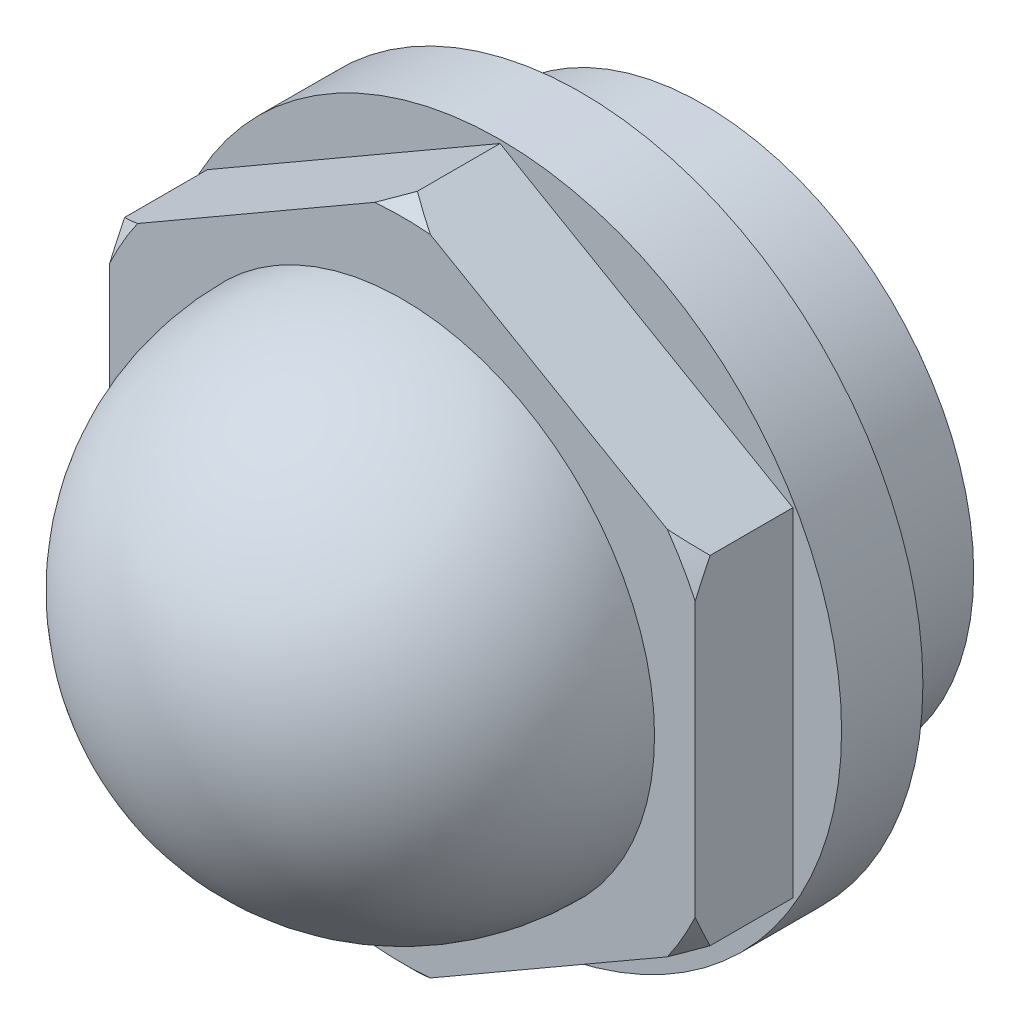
ISO-10303-21;
HEADER;
FILE_DESCRIPTION(('STEP AP214'),'2;1');
FILE_NAME('part.step','',(''),(''),'','','');
FILE_SCHEMA(('AUTOMOTIVE_DESIGN { 1 0 10303 214 1 1 1 1 }'));
ENDSEC;
DATA;
#1=APPLICATION_CONTEXT('core data for automotive mechanical design processes');
#2=APPLICATION_PROTOCOL_DEFINITION('international standard','automotive_design',2000,#1);
#3=PRODUCT_CONTEXT('',#1,'mechanical');
#4=PRODUCT('Part','Part','',(#3));
#5=PRODUCT_RELATED_PRODUCT_CATEGORY('part','',(#4));
#6=PRODUCT_DEFINITION_FORMATION('','',#4);
#7=PRODUCT_DEFINITION_CONTEXT('part definition',#1,'design');
#8=PRODUCT_DEFINITION('design','',#6,#7);
#9=PRODUCT_DEFINITION_SHAPE('','',#8);
#10=(LENGTH_UNIT() NAMED_UNIT(*) SI_UNIT(.MILLI.,.METRE.));
#11=(NAMED_UNIT(*) PLANE_ANGLE_UNIT() SI_UNIT($,.RADIAN.));
#12=(NAMED_UNIT(*) SI_UNIT($,.STERADIAN.) SOLID_ANGLE_UNIT());
#13=UNCERTAINTY_MEASURE_WITH_UNIT(LENGTH_MEASURE(1.E-05),#10,'distance_accuracy_value','');
#14=(GEOMETRIC_REPRESENTATION_CONTEXT(3) GLOBAL_UNCERTAINTY_ASSIGNED_CONTEXT((#13)) GLOBAL_UNIT_ASSIGNED_CONTEXT((#10,
#11,#12)) REPRESENTATION_CONTEXT('',''));
#15=CARTESIAN_POINT('',(0.,0.,0.));
#16=DIRECTION('',(0.,0.,1.));
#17=DIRECTION('',(1.,0.,0.));
#18=AXIS2_PLACEMENT_3D('',#15,#16,#17);
#19=CARTESIAN_POINT('',(0.,0.,-11.));
#20=DIRECTION('',(0.,0.,-1.));
#21=DIRECTION('',(1.,0.,0.));
#22=AXIS2_PLACEMENT_3D('',#19,#20,#21);
#23=CYLINDRICAL_SURFACE('',#22,21.);
#24=CARTESIAN_POINT('',(0.,0.,0.));
#25=DIRECTION('',(0.,0.,-1.));
#26=DIRECTION('',(1.,0.,0.));
#27=AXIS2_PLACEMENT_3D('',#24,#25,#26);
#28=CIRCLE('',#27,21.);
#29=CARTESIAN_POINT('',(21.,0.,0.));
#30=VERTEX_POINT('',#29);
#31=EDGE_CURVE('E251',#30,#30,#28,.T.);
#32=ORIENTED_EDGE('',*,*,#31,.F.);
#33=EDGE_LOOP('',(#32));
#34=FACE_BOUND('',#33,.T.);
#35=CARTESIAN_POINT('',(0.,0.,5.));
#36=DIRECTION('',(0.,0.,1.));
#37=DIRECTION('',(-1.,0.,0.));
#38=AXIS2_PLACEMENT_3D('',#35,#36,#37);
#39=CIRCLE('',#38,21.);
#40=CARTESIAN_POINT('',(-21.,0.,5.));
#41=VERTEX_POINT('',#40);
#42=EDGE_CURVE('E18',#41,#41,#39,.T.);
#43=ORIENTED_EDGE('',*,*,#42,.F.);
#44=EDGE_LOOP('',(#43));
#45=FACE_BOUND('',#44,.T.);
#46=ADVANCED_FACE('F14',(#34,#45),#23,.T.);
#47=CARTESIAN_POINT('',(0.,-15.1455,-7.5));
#48=DIRECTION('',(0.,0.,-1.));
#49=DIRECTION('',(1.,0.,0.));
#50=AXIS2_PLACEMENT_3D('',#47,#48,#49);
#51=PLANE('',#50);
#52=CARTESIAN_POINT('',(0.,0.,-7.5));
#53=DIRECTION('',(0.,0.,-1.));
#54=DIRECTION('',(1.,0.,0.));
#55=AXIS2_PLACEMENT_3D('',#52,#53,#54);
#56=CIRCLE('',#55,16.6245000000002);
#57=CARTESIAN_POINT('',(16.6245000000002,0.,-7.5));
#58=VERTEX_POINT('',#57);
#59=EDGE_CURVE('E9',#58,#58,#56,.T.);
#60=ORIENTED_EDGE('',*,*,#59,.T.);
#61=EDGE_LOOP('',(#60));
#62=FACE_BOUND('',#61,.T.);
#63=CARTESIAN_POINT('',(0.,0.,-7.5));
#64=DIRECTION('',(0.,0.,-1.));
#65=DIRECTION('',(1.,0.,0.));
#66=AXIS2_PLACEMENT_3D('',#63,#64,#65);
#67=CIRCLE('',#66,15.1455);
#68=CARTESIAN_POINT('',(15.1455,0.,-7.5));
#69=VERTEX_POINT('',#68);
#70=EDGE_CURVE('E238',#69,#69,#67,.T.);
#71=ORIENTED_EDGE('',*,*,#70,.F.);
#72=EDGE_LOOP('',(#71));
#73=FACE_BOUND('',#72,.T.);
#74=ADVANCED_FACE('F16',(#62,#73),#51,.T.);
#75=CARTESIAN_POINT('',(0.,0.,-11.));
#76=DIRECTION('',(0.,0.,-1.));
#77=DIRECTION('',(1.,0.,0.));
#78=AXIS2_PLACEMENT_3D('',#75,#76,#77);
#79=CYLINDRICAL_SURFACE('',#78,16.6245000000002);
#80=ORIENTED_EDGE('',*,*,#59,.F.);
#81=EDGE_LOOP('',(#80));
#82=FACE_BOUND('',#81,.T.);
#83=CARTESIAN_POINT('',(0.,0.,0.));
#84=DIRECTION('',(0.,0.,-1.));
#85=DIRECTION('',(1.,0.,0.));
#86=AXIS2_PLACEMENT_3D('',#83,#84,#85);
#87=CIRCLE('',#86,16.6245000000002);
#88=CARTESIAN_POINT('',(16.6245000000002,0.,0.));
#89=VERTEX_POINT('',#88);
#90=EDGE_CURVE('E23',#89,#89,#87,.T.);
#91=ORIENTED_EDGE('',*,*,#90,.T.);
#92=EDGE_LOOP('',(#91));
#93=FACE_BOUND('',#92,.T.);
#94=ADVANCED_FACE('F258',(#82,#93),#79,.T.);
#95=CARTESIAN_POINT('',(0.,-21.,0.));
#96=DIRECTION('',(0.,0.,1.));
#97=DIRECTION('',(-1.,0.,0.));
#98=AXIS2_PLACEMENT_3D('',#95,#96,#97);
#99=PLANE('',#98);
#100=ORIENTED_EDGE('',*,*,#90,.F.);
#101=EDGE_LOOP('',(#100));
#102=FACE_BOUND('',#101,.T.);
#103=ORIENTED_EDGE('',*,*,#31,.T.);
#104=EDGE_LOOP('',(#103));
#105=FACE_BOUND('',#104,.T.);
#106=ADVANCED_FACE('F260',(#102,#105),#99,.F.);
#107=CARTESIAN_POINT('',(0.,0.,-8.5));
#108=DIRECTION('',(0.,0.,-1.));
#109=DIRECTION('',(1.,0.,0.));
#110=AXIS2_PLACEMENT_3D('',#107,#108,#109);
#111=PLANE('',#110);
#112=CARTESIAN_POINT('',(0.,0.,-8.5));
#113=DIRECTION('',(0.,0.,-1.));
#114=DIRECTION('',(1.,0.,0.));
#115=AXIS2_PLACEMENT_3D('',#112,#113,#114);
#116=CIRCLE('',#115,15.1455);
#117=CARTESIAN_POINT('',(15.1455,0.,-8.5));
#118=VERTEX_POINT('',#117);
#119=EDGE_CURVE('E241',#118,#118,#116,.T.);
#120=ORIENTED_EDGE('',*,*,#119,.T.);
#121=EDGE_LOOP('',(#120));
#122=FACE_BOUND('',#121,.T.);
#123=ADVANCED_FACE('F263',(#122),#111,.T.);
#124=CARTESIAN_POINT('',(0.,0.,-11.));
#125=DIRECTION('',(0.,0.,-1.));
#126=DIRECTION('',(1.,0.,0.));
#127=AXIS2_PLACEMENT_3D('',#124,#125,#126);
#128=CYLINDRICAL_SURFACE('',#127,15.1455);
#129=ORIENTED_EDGE('',*,*,#119,.F.);
#130=EDGE_LOOP('',(#129));
#131=FACE_BOUND('',#130,.T.);
#132=ORIENTED_EDGE('',*,*,#70,.T.);
#133=EDGE_LOOP('',(#132));
#134=FACE_BOUND('',#133,.T.);
#135=ADVANCED_FACE('F272',(#131,#134),#128,.T.);
#136=CARTESIAN_POINT('',(0.,0.,5.));
#137=DIRECTION('',(0.,0.,1.));
#138=DIRECTION('',(-1.,0.,0.));
#139=AXIS2_PLACEMENT_3D('',#136,#137,#138);
#140=PLANE('',#139);
#141=DIRECTION('',(0.,1.,0.));
#142=VECTOR('',#141,1.);
#143=CARTESIAN_POINT('',(-17.9999999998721,-10.3923048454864,5.));
#144=LINE('',#143,#142);
#145=CARTESIAN_POINT('',(-17.9999999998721,-10.3923048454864,5.));
#146=VERTEX_POINT('',#145);
#147=CARTESIAN_POINT('',(-17.9999999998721,10.39230484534,5.));
#148=VERTEX_POINT('',#147);
#149=EDGE_CURVE('E112',#146,#148,#144,.T.);
#150=ORIENTED_EDGE('',*,*,#149,.T.);
#151=DIRECTION('',(0.866025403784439,0.5,0.));
#152=VECTOR('',#151,1.);
#153=CARTESIAN_POINT('',(-17.9999999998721,10.39230484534,5.));
#154=LINE('',#153,#152);
#155=CARTESIAN_POINT('',(1.27921978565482E-10,20.7846096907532,5.));
#156=VERTEX_POINT('',#155);
#157=EDGE_CURVE('E139',#148,#156,#154,.T.);
#158=ORIENTED_EDGE('',*,*,#157,.T.);
#159=DIRECTION('',(-0.866025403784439,0.5,0.));
#160=VECTOR('',#159,1.);
#161=CARTESIAN_POINT('',(18.0000000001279,10.39230484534,5.));
#162=LINE('',#161,#160);
#163=CARTESIAN_POINT('',(18.0000000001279,10.39230484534,5.));
#164=VERTEX_POINT('',#163);
#165=EDGE_CURVE('E136',#164,#156,#162,.T.);
#166=ORIENTED_EDGE('',*,*,#165,.F.);
#167=DIRECTION('',(0.,1.,0.));
#168=VECTOR('',#167,1.);
#169=CARTESIAN_POINT('',(18.0000000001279,-10.3923048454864,5.));
#170=LINE('',#169,#168);
#171=CARTESIAN_POINT('',(18.0000000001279,-10.3923048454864,5.));
#172=VERTEX_POINT('',#171);
#173=EDGE_CURVE('E123',#172,#164,#170,.T.);
#174=ORIENTED_EDGE('',*,*,#173,.F.);
#175=DIRECTION('',(-0.866025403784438,-0.5,0.));
#176=VECTOR('',#175,1.);
#177=CARTESIAN_POINT('',(18.0000000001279,-10.3923048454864,5.));
#178=LINE('',#177,#176);
#179=CARTESIAN_POINT('',(1.27935856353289E-10,-20.7846096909,5.));
#180=VERTEX_POINT('',#179);
#181=EDGE_CURVE('E107',#172,#180,#178,.T.);
#182=ORIENTED_EDGE('',*,*,#181,.T.);
#183=DIRECTION('',(0.866025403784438,-0.5,0.));
#184=VECTOR('',#183,1.);
#185=CARTESIAN_POINT('',(-17.9999999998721,-10.3923048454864,5.));
#186=LINE('',#185,#184);
#187=EDGE_CURVE('E119',#146,#180,#186,.T.);
#188=ORIENTED_EDGE('',*,*,#187,.F.);
#189=EDGE_LOOP('',(#150,#158,#166,#174,#182,#188));
#190=FACE_BOUND('',#189,.T.);
#191=ORIENTED_EDGE('',*,*,#42,.T.);
#192=EDGE_LOOP('',(#191));
#193=FACE_BOUND('',#192,.T.);
#194=ADVANCED_FACE('F117',(#190,#193),#140,.T.);
#195=CARTESIAN_POINT('',(-17.9999999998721,-10.3923048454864,5.));
#196=DIRECTION('',(-0.5,-0.866025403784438,0.));
#197=DIRECTION('',(-0.866025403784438,0.5,0.));
#198=AXIS2_PLACEMENT_3D('',#195,#196,#197);
#199=PLANE('',#198);
#200=CARTESIAN_POINT('',(0.854085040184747,-21.2777159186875,9.57524039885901));
#201=CARTESIAN_POINT('',(0.590182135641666,-21.1253515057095,9.73804720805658));
#202=CARTESIAN_POINT('',(0.324592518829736,-20.9720132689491,9.89725928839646));
#203=CARTESIAN_POINT('',(-0.210225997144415,-20.6632356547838,10.2075164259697));
#204=CARTESIAN_POINT('',(-0.479455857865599,-20.5077957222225,10.3585592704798));
#205=CARTESIAN_POINT('',(-1.02266847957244,-20.1941717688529,10.6519461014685));
#206=CARTESIAN_POINT('',(-1.2966650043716,-20.0359798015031,10.7942563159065));
#207=CARTESIAN_POINT('',(-1.84852744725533,-19.7173618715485,11.0683576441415));
#208=CARTESIAN_POINT('',(-2.12639308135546,-19.5569360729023,11.2001495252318));
#209=CARTESIAN_POINT('',(-2.97095114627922,-19.0693302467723,11.5800545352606));
#210=CARTESIAN_POINT('',(-3.54395714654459,-18.7385050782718,11.8101390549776));
#211=CARTESIAN_POINT('',(-4.4145661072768,-18.2358587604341,12.1102186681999));
#212=CARTESIAN_POINT('',(-4.70644110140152,-18.0673446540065,12.2026954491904));
#213=CARTESIAN_POINT('',(-5.29371180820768,-17.7282837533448,12.3712371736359));
#214=CARTESIAN_POINT('',(-5.5891070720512,-17.5577372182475,12.4473041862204));
#215=CARTESIAN_POINT('',(-6.27317343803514,-17.1627913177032,12.602027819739));
#216=CARTESIAN_POINT('',(-6.66292135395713,-16.9377702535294,12.6744520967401));
#217=CARTESIAN_POINT('',(-7.4460332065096,-16.4856404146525,12.7864382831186));
#218=CARTESIAN_POINT('',(-7.83939769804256,-16.2585313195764,12.8259950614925));
#219=CARTESIAN_POINT('',(-8.62566391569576,-15.8045803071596,12.870582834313));
#220=CARTESIAN_POINT('',(-9.01855839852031,-15.5777425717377,12.8757827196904));
#221=CARTESIAN_POINT('',(-9.80344627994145,-15.1245873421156,12.8518883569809));
#222=CARTESIAN_POINT('',(-10.1954399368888,-14.8982696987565,12.8228056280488));
#223=CARTESIAN_POINT('',(-10.8483911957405,-14.5212881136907,12.7465069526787));
#224=CARTESIAN_POINT('',(-11.110177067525,-14.3701459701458,12.7083614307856));
#225=CARTESIAN_POINT('',(-11.6321808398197,-14.0687669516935,12.6177212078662));
#226=CARTESIAN_POINT('',(-11.8923966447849,-13.9185312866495,12.565210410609));
#227=CARTESIAN_POINT('',(-12.4484769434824,-13.5974781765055,12.4379728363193));
#228=CARTESIAN_POINT('',(-12.7439763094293,-13.4268715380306,12.3611179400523));
#229=CARTESIAN_POINT('',(-13.3314341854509,-13.0877025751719,12.1910324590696));
#230=CARTESIAN_POINT('',(-13.6233920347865,-12.919140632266,12.0977988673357));
#231=CARTESIAN_POINT('',(-14.494408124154,-12.4162592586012,11.795446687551));
#232=CARTESIAN_POINT('',(-15.0677118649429,-12.0852621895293,11.5638902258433));
#233=CARTESIAN_POINT('',(-15.9142661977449,-11.5965038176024,11.1811818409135));
#234=CARTESIAN_POINT('',(-16.1938188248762,-11.4351040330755,11.0479370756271));
#235=CARTESIAN_POINT('',(-16.7490101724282,-11.1145641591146,10.7708529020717));
#236=CARTESIAN_POINT('',(-17.0246485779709,-10.9554242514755,10.6270126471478));
#237=CARTESIAN_POINT('',(-17.5710089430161,-10.6399829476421,10.330560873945));
#238=CARTESIAN_POINT('',(-17.8417460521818,-10.4836728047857,10.1779863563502));
#239=CARTESIAN_POINT('',(-18.3795430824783,-10.1731755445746,9.86462743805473));
#240=CARTESIAN_POINT('',(-18.6466040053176,-10.0189878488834,9.70384533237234));
#241=CARTESIAN_POINT('',(-18.9119644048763,-9.86578195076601,9.53945441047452));
#242=B_SPLINE_CURVE_WITH_KNOTS('',3,(#200,#201,#202,#203,#204,#205,#206,#207,#208,#209,#210,
#211,#212,#213,#214,#215,#216,#217,#218,#219,#220,#221,#222,#223,#224,#225,#226,#227,#228,#229,
#230,#231,#232,#233,#234,#235,#236,#237,#238,#239,#240,#241),.UNSPECIFIED.,.F.,.F.,(4,2,2,2,2,2,
2,2,2,2,2,2,2,2,2,2,2,2,2,2,4),(0.,1.03648915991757,2.0732576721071,3.11381133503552,
4.15428902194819,6.25304513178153,7.30116943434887,8.3491615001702,9.71549763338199,
11.0820470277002,12.4418737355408,13.8012436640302,14.7149633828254,15.629711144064,
16.6785335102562,17.7275486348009,19.8287398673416,20.8762796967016,21.9239033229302,
22.9673772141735,24.0105609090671),.UNSPECIFIED.);
#243=CARTESIAN_POINT('',(1.27935856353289E-10,-20.7846096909,10.085481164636));
#244=VERTEX_POINT('',#243);
#245=CARTESIAN_POINT('',(-1.71196988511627,-19.7962034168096,11.));
#246=VERTEX_POINT('',#245);
#247=EDGE_CURVE('E38',#244,#246,#242,.T.);
#248=ORIENTED_EDGE('',*,*,#247,.T.);
#249=DIRECTION('',(0.866025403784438,-0.5,0.));
#250=VECTOR('',#249,1.);
#251=CARTESIAN_POINT('',(-17.9999999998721,-10.3923048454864,11.));
#252=LINE('',#251,#250);
#253=CARTESIAN_POINT('',(-16.2880301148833,-11.3807111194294,11.));
#254=VERTEX_POINT('',#253);
#255=EDGE_CURVE('E302',#254,#246,#252,.T.);
#256=ORIENTED_EDGE('',*,*,#255,.F.);
#257=CARTESIAN_POINT('',(-17.9999999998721,-10.3923048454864,10.0854811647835));
#258=VERTEX_POINT('',#257);
#259=EDGE_CURVE('E232',#254,#258,#242,.T.);
#260=ORIENTED_EDGE('',*,*,#259,.T.);
#261=DIRECTION('',(0.,0.,1.));
#262=VECTOR('',#261,1.);
#263=CARTESIAN_POINT('',(-17.9999999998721,-10.3923048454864,5.));
#264=LINE('',#263,#262);
#265=EDGE_CURVE('E128',#146,#258,#264,.T.);
#266=ORIENTED_EDGE('',*,*,#265,.F.);
#267=ORIENTED_EDGE('',*,*,#187,.T.);
#268=DIRECTION('',(0.,0.,1.));
#269=VECTOR('',#268,1.);
#270=CARTESIAN_POINT('',(1.27935856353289E-10,-20.7846096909,5.));
#271=LINE('',#270,#269);
#272=EDGE_CURVE('E104',#180,#244,#271,.T.);
#273=ORIENTED_EDGE('',*,*,#272,.T.);
#274=EDGE_LOOP('',(#248,#256,#260,#266,#267,#273));
#275=FACE_BOUND('',#274,.T.);
#276=ADVANCED_FACE('F126',(#275),#199,.T.);
#277=CARTESIAN_POINT('',(-17.9999999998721,-10.3923048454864,5.));
#278=DIRECTION('',(1.,0.,0.));
#279=DIRECTION('',(0.,-1.,0.));
#280=AXIS2_PLACEMENT_3D('',#277,#278,#279);
#281=PLANE('',#280);
#282=DIRECTION('',(0.,0.,1.));
#283=VECTOR('',#282,1.);
#284=CARTESIAN_POINT('',(-17.9999999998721,10.39230484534,5.));
#285=LINE('',#284,#283);
#286=CARTESIAN_POINT('',(-17.9999999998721,10.39230484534,10.0854811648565));
#287=VERTEX_POINT('',#286);
#288=EDGE_CURVE('E150',#148,#287,#285,.T.);
#289=ORIENTED_EDGE('',*,*,#288,.F.);
#290=ORIENTED_EDGE('',*,*,#149,.F.);
#291=ORIENTED_EDGE('',*,*,#265,.T.);
#292=CARTESIAN_POINT('',(-17.9999999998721,-0.535446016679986,12.862128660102));
#293=CARTESIAN_POINT('',(-17.9999999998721,-0.818123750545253,12.8537566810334));
#294=CARTESIAN_POINT('',(-17.9999999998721,-1.1005848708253,12.8386756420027));
#295=CARTESIAN_POINT('',(-17.9999999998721,-1.66445321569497,12.7954756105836));
#296=CARTESIAN_POINT('',(-17.9999999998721,-1.9458606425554,12.7673592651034));
#297=CARTESIAN_POINT('',(-17.9999999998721,-2.50668019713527,12.6985185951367));
#298=CARTESIAN_POINT('',(-17.9999999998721,-2.78609474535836,12.6578139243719));
#299=CARTESIAN_POINT('',(-17.9999999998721,-3.3428947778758,12.5643652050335));
#300=CARTESIAN_POINT('',(-17.9999999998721,-3.62028018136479,12.5116206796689));
#301=CARTESIAN_POINT('',(-17.9999999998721,-4.44268644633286,12.33761301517));
#302=CARTESIAN_POINT('',(-17.9999999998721,-4.98425433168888,12.1997735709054));
#303=CARTESIAN_POINT('',(-17.9999999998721,-6.05593755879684,11.8855832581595));
#304=CARTESIAN_POINT('',(-17.9999999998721,-6.5860527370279,11.7092318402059));
#305=CARTESIAN_POINT('',(-17.9999999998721,-7.27196481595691,11.4572391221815));
#306=CARTESIAN_POINT('',(-17.9999999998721,-7.43326662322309,11.3962231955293));
#307=CARTESIAN_POINT('',(-17.9999999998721,-7.67446538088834,11.3024665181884));
#308=CARTESIAN_POINT('',(-17.9999999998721,-7.75478681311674,11.2708226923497));
#309=CARTESIAN_POINT('',(-17.9999999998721,-7.91513998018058,11.206824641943));
#310=CARTESIAN_POINT('',(-17.9999999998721,-7.99517173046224,11.1744704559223));
#311=CARTESIAN_POINT('',(-17.9999999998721,-8.48412758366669,10.9743351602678));
#312=CARTESIAN_POINT('',(-17.9999999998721,-8.88951398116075,10.7978210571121));
#313=CARTESIAN_POINT('',(-17.9999999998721,-9.69316997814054,10.4292005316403));
#314=CARTESIAN_POINT('',(-17.9999999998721,-10.0914380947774,10.2370909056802));
#315=CARTESIAN_POINT('',(-17.9999999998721,-10.8815344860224,9.83937063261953));
#316=CARTESIAN_POINT('',(-17.9999999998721,-11.273357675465,9.63374990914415));
#317=CARTESIAN_POINT('',(-17.9999999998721,-12.0507272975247,9.21105979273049));
#318=CARTESIAN_POINT('',(-17.9999999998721,-12.4362740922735,8.99399106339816));
#319=CARTESIAN_POINT('',(-17.9999999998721,-13.2033332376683,8.54902487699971));
#320=CARTESIAN_POINT('',(-17.9999999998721,-13.5848202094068,8.32108378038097));
#321=CARTESIAN_POINT('',(-17.9999999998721,-14.3425545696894,7.85663243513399));
#322=CARTESIAN_POINT('',(-17.9999999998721,-14.7188017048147,7.62012177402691));
#323=CARTESIAN_POINT('',(-17.9999999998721,-15.4663881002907,7.13979085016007));
#324=CARTESIAN_POINT('',(-17.9999999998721,-15.8377291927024,6.89597343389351));
#325=CARTESIAN_POINT('',(-17.9999999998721,-16.5761100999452,6.40190261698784));
#326=CARTESIAN_POINT('',(-17.9999999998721,-16.9431497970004,6.15164904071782));
#327=CARTESIAN_POINT('',(-17.9999999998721,-18.0223215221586,5.40367114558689));
#328=CARTESIAN_POINT('',(-17.9999999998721,-18.7289772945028,4.89803763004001));
#329=CARTESIAN_POINT('',(-17.9999999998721,-20.1301537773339,3.87015084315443));
#330=CARTESIAN_POINT('',(-17.999999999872,-20.8246730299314,3.34789559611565));
#331=CARTESIAN_POINT('',(-17.999999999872,-22.1961833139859,2.29599339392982));
#332=CARTESIAN_POINT('',(-17.999999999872,-22.8732826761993,1.76648744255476));
#333=CARTESIAN_POINT('',(-17.999999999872,-23.8826643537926,0.964571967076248));
#334=CARTESIAN_POINT('',(-17.999999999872,-24.2180321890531,0.696030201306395));
#335=CARTESIAN_POINT('',(-17.999999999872,-24.8868780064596,0.156614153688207));
#336=CARTESIAN_POINT('',(-17.999999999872,-25.2203560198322,-0.114260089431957));
#337=CARTESIAN_POINT('',(-17.9999999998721,-25.5529774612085,-0.386183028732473));
#338=B_SPLINE_CURVE_WITH_KNOTS('',3,(#292,#293,#294,#295,#296,#297,#298,#299,#300,#301,#302,
#303,#304,#305,#306,#307,#308,#309,#310,#311,#312,#313,#314,#315,#316,#317,#318,#319,#320,#321,
#322,#323,#324,#325,#326,#327,#328,#329,#330,#331,#332,#333,#334,#335,#336,#337),.UNSPECIFIED.,
.F.,.F.,(4,2,2,2,2,2,2,2,2,2,2,2,2,2,2,2,2,2,2,2,2,2,4),(0.,0.848298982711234,1.69642578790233,
2.54323507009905,3.39007789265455,5.06478094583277,6.73950789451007,7.25686253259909,
7.51584783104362,7.77481911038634,9.10081728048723,10.4270885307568,11.7543603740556,
13.0815553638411,14.4146191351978,15.747747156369,17.0803624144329,18.4130140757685,
21.0194330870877,23.6261630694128,26.204704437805,27.4936014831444,28.7824771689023),.UNSPECIFIED.);
#339=CARTESIAN_POINT('',(-17.9999999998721,-8.41549229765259,11.));
#340=VERTEX_POINT('',#339);
#341=EDGE_CURVE('E207',#340,#258,#338,.T.);
#342=ORIENTED_EDGE('',*,*,#341,.F.);
#343=DIRECTION('',(0.,1.,0.));
#344=VECTOR('',#343,1.);
#345=CARTESIAN_POINT('',(-17.9999999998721,-10.3923048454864,11.));
#346=LINE('',#345,#344);
#347=CARTESIAN_POINT('',(-17.9999999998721,8.4154922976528,11.));
#348=VERTEX_POINT('',#347);
#349=EDGE_CURVE('E129',#340,#348,#346,.T.);
#350=ORIENTED_EDGE('',*,*,#349,.T.);
#351=CARTESIAN_POINT('',(-17.9999999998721,25.5529774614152,-0.386183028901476));
#352=CARTESIAN_POINT('',(-17.9999999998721,25.2081058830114,-0.104249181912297));
#353=CARTESIAN_POINT('',(-17.9999999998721,24.8623139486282,0.176562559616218));
#354=CARTESIAN_POINT('',(-17.9999999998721,24.1686911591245,0.735669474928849));
#355=CARTESIAN_POINT('',(-17.9999999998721,23.8208602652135,1.0139646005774));
#356=CARTESIAN_POINT('',(-17.9999999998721,23.1228538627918,1.56785087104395));
#357=CARTESIAN_POINT('',(-17.9999999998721,22.7726775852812,1.84344104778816));
#358=CARTESIAN_POINT('',(-17.9999999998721,22.0698795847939,2.39148061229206));
#359=CARTESIAN_POINT('',(-17.9999999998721,21.7172578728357,2.66393001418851));
#360=CARTESIAN_POINT('',(-17.9999999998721,20.6473835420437,3.48211555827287));
#361=CARTESIAN_POINT('',(-17.9999999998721,19.9259700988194,4.02243500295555));
#362=CARTESIAN_POINT('',(-17.9999999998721,18.4698147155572,5.08471248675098));
#363=CARTESIAN_POINT('',(-17.9999999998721,17.7350745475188,5.6066729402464));
#364=CARTESIAN_POINT('',(-17.9999999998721,16.6391590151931,6.3589492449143));
#365=CARTESIAN_POINT('',(-17.9999999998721,16.2843399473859,6.59853567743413));
#366=CARTESIAN_POINT('',(-17.9999999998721,15.570603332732,7.0715158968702));
#367=CARTESIAN_POINT('',(-17.9999999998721,15.2116858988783,7.30490985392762));
#368=CARTESIAN_POINT('',(-17.9999999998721,14.4892152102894,7.76468661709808));
#369=CARTESIAN_POINT('',(-17.9999999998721,14.1256604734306,7.99106709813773));
#370=CARTESIAN_POINT('',(-17.9999999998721,13.3935991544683,8.43565468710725));
#371=CARTESIAN_POINT('',(-17.9999999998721,13.0250927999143,8.65386216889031));
#372=CARTESIAN_POINT('',(-17.9999999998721,12.2841635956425,9.07997388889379));
#373=CARTESIAN_POINT('',(-17.9999999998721,11.9117629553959,9.28791664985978));
#374=CARTESIAN_POINT('',(-17.9999999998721,11.1610838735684,9.69298231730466));
#375=CARTESIAN_POINT('',(-17.9999999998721,10.782805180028,9.89010475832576));
#376=CARTESIAN_POINT('',(-17.9999999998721,10.0201693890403,10.2716720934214));
#377=CARTESIAN_POINT('',(-17.9999999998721,9.63581605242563,10.456124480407));
#378=CARTESIAN_POINT('',(-17.9999999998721,8.86047867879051,10.8104495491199));
#379=CARTESIAN_POINT('',(-17.9999999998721,8.46949565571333,10.9803244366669));
#380=CARTESIAN_POINT('',(-17.9999999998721,7.77789383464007,11.2634046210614));
#381=CARTESIAN_POINT('',(-17.9999999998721,7.47876648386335,11.3802545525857));
#382=CARTESIAN_POINT('',(-17.9999999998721,6.87656081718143,11.6033093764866));
#383=CARTESIAN_POINT('',(-17.9999999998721,6.57348259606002,11.7095145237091));
#384=CARTESIAN_POINT('',(-17.9999999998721,5.96361663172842,11.9100840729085));
#385=CARTESIAN_POINT('',(-17.9999999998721,5.65683116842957,12.0044553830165));
#386=CARTESIAN_POINT('',(-17.9999999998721,5.03955393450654,12.1802652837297));
#387=CARTESIAN_POINT('',(-17.9999999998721,4.72906207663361,12.2617035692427));
#388=CARTESIAN_POINT('',(-17.9999999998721,4.09937610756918,12.4117640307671));
#389=CARTESIAN_POINT('',(-17.9999999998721,3.78012391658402,12.480143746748));
#390=CARTESIAN_POINT('',(-17.9999999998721,3.13867014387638,12.6012094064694));
#391=CARTESIAN_POINT('',(-17.9999999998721,2.8164688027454,12.6538966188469));
#392=CARTESIAN_POINT('',(-17.9999999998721,2.16864098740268,12.7427668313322));
#393=CARTESIAN_POINT('',(-17.9999999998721,1.84300650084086,12.7788918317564));
#394=CARTESIAN_POINT('',(-17.9999999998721,1.19016349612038,12.8337364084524));
#395=CARTESIAN_POINT('',(-17.9999999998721,0.862954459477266,12.8524497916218));
#396=CARTESIAN_POINT('',(-17.9999999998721,0.535446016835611,12.8621286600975));
#397=B_SPLINE_CURVE_WITH_KNOTS('',3,(#351,#352,#353,#354,#355,#356,#357,#358,#359,#360,#361,
#362,#363,#364,#365,#366,#367,#368,#369,#370,#371,#372,#373,#374,#375,#376,#377,#378,#379,#380,
#381,#382,#383,#384,#385,#386,#387,#388,#389,#390,#391,#392,#393,#394,#395,#396),.UNSPECIFIED.,
.F.,.F.,(4,2,2,2,2,2,2,2,2,2,2,2,2,2,2,2,2,2,2,2,2,2,4),(0.,1.33634221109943,2.67270992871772,
4.00953965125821,5.34636335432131,8.05011207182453,10.7535038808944,12.0378524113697,
13.3221656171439,14.6069001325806,15.8915758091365,17.1709922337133,18.4504636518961,
19.7291717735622,21.0076860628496,21.9709314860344,22.934153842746,23.8968112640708,
24.8594913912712,25.8386019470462,26.8176333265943,27.8000674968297,28.7828509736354),.UNSPECIFIED.);
#398=EDGE_CURVE('E225',#287,#348,#397,.T.);
#399=ORIENTED_EDGE('',*,*,#398,.F.);
#400=EDGE_LOOP('',(#289,#290,#291,#342,#350,#399));
#401=FACE_BOUND('',#400,.T.);
#402=ADVANCED_FACE('F217',(#401),#281,.F.);
#403=CARTESIAN_POINT('',(-17.9999999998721,10.39230484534,5.));
#404=DIRECTION('',(0.5,-0.866025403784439,0.));
#405=DIRECTION('',(-0.866025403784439,-0.5,0.));
#406=AXIS2_PLACEMENT_3D('',#403,#404,#405);
#407=PLANE('',#406);
#408=DIRECTION('',(0.,0.,1.));
#409=VECTOR('',#408,1.);
#410=CARTESIAN_POINT('',(1.27921978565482E-10,20.7846096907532,5.));
#411=LINE('',#410,#409);
#412=CARTESIAN_POINT('',(1.27921978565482E-10,20.7846096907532,10.0854811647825));
#413=VERTEX_POINT('',#412);
#414=EDGE_CURVE('E147',#156,#413,#411,.T.);
#415=ORIENTED_EDGE('',*,*,#414,.F.);
#416=ORIENTED_EDGE('',*,*,#157,.F.);
#417=ORIENTED_EDGE('',*,*,#288,.T.);
#418=CARTESIAN_POINT('',(0.854085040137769,21.2777159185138,9.57524039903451));
#419=CARTESIAN_POINT('',(0.590182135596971,21.1253515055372,9.73804720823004));
#420=CARTESIAN_POINT('',(0.324592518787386,20.9720132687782,9.89725928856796));
#421=CARTESIAN_POINT('',(-0.210225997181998,20.6632356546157,10.2075164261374));
#422=CARTESIAN_POINT('',(-0.47945585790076,20.5077957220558,10.3585592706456));
#423=CARTESIAN_POINT('',(-1.02266847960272,20.194171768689,10.6519461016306));
#424=CARTESIAN_POINT('',(-1.29666500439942,20.0359798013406,10.7942563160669));
#425=CARTESIAN_POINT('',(-1.84852744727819,19.7173618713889,11.0683576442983));
#426=CARTESIAN_POINT('',(-2.12639308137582,19.5569360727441,11.2001495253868));
#427=CARTESIAN_POINT('',(-2.97095114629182,19.0693302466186,11.5800545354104));
#428=CARTESIAN_POINT('',(-3.54395714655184,18.7385050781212,11.8101390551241));
#429=CARTESIAN_POINT('',(-4.41456610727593,18.2358587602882,12.1102186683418));
#430=CARTESIAN_POINT('',(-4.70644110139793,18.0673446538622,12.2026954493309));
#431=CARTESIAN_POINT('',(-5.29371180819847,17.7282837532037,12.3712371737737));
#432=CARTESIAN_POINT('',(-5.5891070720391,17.5577372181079,12.4473041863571));
#433=CARTESIAN_POINT('',(-6.27317343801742,17.1627913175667,12.6020278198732));
#434=CARTESIAN_POINT('',(-6.66292135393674,16.9377702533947,12.6744520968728));
#435=CARTESIAN_POINT('',(-7.44603320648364,16.4856404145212,12.786438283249));
#436=CARTESIAN_POINT('',(-7.83939769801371,16.2585313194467,12.8259950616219));
#437=CARTESIAN_POINT('',(-8.62566391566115,15.8045803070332,12.8705828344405));
#438=CARTESIAN_POINT('',(-9.01855839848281,15.5777425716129,12.8757827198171));
#439=CARTESIAN_POINT('',(-9.80344627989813,15.1245873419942,12.8518883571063));
#440=CARTESIAN_POINT('',(-10.1954399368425,14.8982696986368,12.8228056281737));
#441=CARTESIAN_POINT('',(-10.848391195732,14.5212881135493,12.746506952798));
#442=CARTESIAN_POINT('',(-11.110177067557,14.370145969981,12.7083614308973));
#443=CARTESIAN_POINT('',(-11.6321808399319,14.0687669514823,12.6177212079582));
#444=CARTESIAN_POINT('',(-11.8923966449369,13.9185312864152,12.565210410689));
#445=CARTESIAN_POINT('',(-12.4484769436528,13.5974781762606,12.4379728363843));
#446=CARTESIAN_POINT('',(-12.7439763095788,13.4268715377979,12.3611179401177));
#447=CARTESIAN_POINT('',(-13.3314341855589,13.0877025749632,12.1910324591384));
#448=CARTESIAN_POINT('',(-13.623392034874,12.9191406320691,12.0977988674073));
#449=CARTESIAN_POINT('',(-14.4944081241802,12.4162592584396,11.7954466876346));
#450=CARTESIAN_POINT('',(-15.0677118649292,12.0852621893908,11.5638902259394));
#451=CARTESIAN_POINT('',(-15.9142661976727,11.5965038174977,11.1811818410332));
#452=CARTESIAN_POINT('',(-16.1938188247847,11.4351040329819,11.0479370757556));
#453=CARTESIAN_POINT('',(-16.7490101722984,11.1145641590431,10.770852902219));
#454=CARTESIAN_POINT('',(-17.0246485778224,10.9554242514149,10.6270126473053));
#455=CARTESIAN_POINT('',(-17.5710089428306,10.6399829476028,10.3305608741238));
#456=CARTESIAN_POINT('',(-17.8417460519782,10.4836728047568,10.1779863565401));
#457=CARTESIAN_POINT('',(-18.3795430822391,10.1731755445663,9.8646274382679));
#458=CARTESIAN_POINT('',(-18.6466040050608,10.0189878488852,9.70384533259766));
#459=CARTESIAN_POINT('',(-18.9119644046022,9.86578195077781,9.53945441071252));
#460=B_SPLINE_CURVE_WITH_KNOTS('',3,(#418,#419,#420,#421,#422,#423,#424,#425,#426,#427,#428,
#429,#430,#431,#432,#433,#434,#435,#436,#437,#438,#439,#440,#441,#442,#443,#444,#445,#446,#447,
#448,#449,#450,#451,#452,#453,#454,#455,#456,#457,#458,#459),.UNSPECIFIED.,.F.,.F.,(4,2,2,2,2,2,
2,2,2,2,2,2,2,2,2,2,2,2,2,2,4),(0.,1.03648915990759,2.07325767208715,3.11381133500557,
4.15428902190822,6.25304513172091,7.30116943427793,8.34916150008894,9.71549763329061,
11.0820470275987,12.4418737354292,13.8012436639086,14.7149633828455,15.6297111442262,
16.6785335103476,17.7275486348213,19.8287398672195,20.8762796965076,21.9239033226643,
22.9673772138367,24.0105609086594),.UNSPECIFIED.);
#461=CARTESIAN_POINT('',(-16.2880301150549,11.3807111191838,11.));
#462=VERTEX_POINT('',#461);
#463=EDGE_CURVE('E199',#462,#287,#460,.T.);
#464=ORIENTED_EDGE('',*,*,#463,.F.);
#465=DIRECTION('',(0.866025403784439,0.5,0.));
#466=VECTOR('',#465,1.);
#467=CARTESIAN_POINT('',(-17.9999999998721,10.39230484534,11.));
#468=LINE('',#467,#466);
#469=CARTESIAN_POINT('',(-1.71196988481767,19.7962034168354,11.));
#470=VERTEX_POINT('',#469);
#471=EDGE_CURVE('E131',#462,#470,#468,.T.);
#472=ORIENTED_EDGE('',*,*,#471,.T.);
#473=EDGE_CURVE('E206',#413,#470,#460,.T.);
#474=ORIENTED_EDGE('',*,*,#473,.F.);
#475=EDGE_LOOP('',(#415,#416,#417,#464,#472,#474));
#476=FACE_BOUND('',#475,.T.);
#477=ADVANCED_FACE('F214',(#476),#407,.F.);
#478=CARTESIAN_POINT('',(18.0000000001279,10.39230484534,5.));
#479=DIRECTION('',(0.5,0.866025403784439,0.));
#480=DIRECTION('',(0.866025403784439,-0.5,0.));
#481=AXIS2_PLACEMENT_3D('',#478,#479,#480);
#482=PLANE('',#481);
#483=CARTESIAN_POINT('',(-0.854085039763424,21.2777159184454,9.57524039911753));
#484=CARTESIAN_POINT('',(-0.589471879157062,21.1249414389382,9.73848521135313));
#485=CARTESIAN_POINT('',(-0.323162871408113,20.9711878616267,9.89811616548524));
#486=CARTESIAN_POINT('',(0.213116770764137,20.6615666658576,10.2091655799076));
#487=CARTESIAN_POINT('',(0.483088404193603,20.5056984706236,10.3605817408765));
#488=CARTESIAN_POINT('',(1.02789219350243,20.1911558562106,10.6547056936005));
#489=CARTESIAN_POINT('',(1.30273935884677,20.032472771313,10.7973766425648));
#490=CARTESIAN_POINT('',(1.85632539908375,19.7128597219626,11.072124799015));
#491=CARTESIAN_POINT('',(2.13506396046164,19.5519299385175,11.2042028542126));
#492=CARTESIAN_POINT('',(2.97909979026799,19.0646256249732,11.583405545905));
#493=CARTESIAN_POINT('',(3.55065489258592,18.7346381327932,11.8126395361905));
#494=CARTESIAN_POINT('',(4.41892729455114,18.2333408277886,12.111624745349));
#495=CARTESIAN_POINT('',(4.70995210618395,18.0653175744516,12.2037564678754));
#496=CARTESIAN_POINT('',(5.29549824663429,17.7272523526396,12.3716960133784));
#497=CARTESIAN_POINT('',(5.59001892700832,17.5572107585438,12.4475068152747));
#498=CARTESIAN_POINT('',(6.14486619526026,17.2368695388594,12.5730101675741));
#499=CARTESIAN_POINT('',(6.40483915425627,17.086774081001,12.6247876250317));
#500=CARTESIAN_POINT('',(6.92632601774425,16.7856934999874,12.71396520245));
#501=CARTESIAN_POINT('',(7.18783784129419,16.6347095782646,12.7513815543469));
#502=CARTESIAN_POINT('',(7.84075179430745,16.2577495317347,12.8259636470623));
#503=CARTESIAN_POINT('',(8.23296867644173,16.0313030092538,12.8540105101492));
#504=CARTESIAN_POINT('',(9.01823423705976,15.5779297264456,12.8757894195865));
#505=CARTESIAN_POINT('',(9.41128315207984,15.351002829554,12.8695098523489));
#506=CARTESIAN_POINT('',(10.1978051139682,14.8969041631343,12.8227563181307));
#507=CARTESIAN_POINT('',(10.5912705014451,14.6697368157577,12.7821119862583));
#508=CARTESIAN_POINT('',(11.3745206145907,14.2175271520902,12.667988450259));
#509=CARTESIAN_POINT('',(11.7643059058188,13.9924845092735,12.5945143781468));
#510=CARTESIAN_POINT('',(12.4494146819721,13.5969367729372,12.4377618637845));
#511=CARTESIAN_POINT('',(12.7458140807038,13.4258105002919,12.3606409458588));
#512=CARTESIAN_POINT('',(13.3350466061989,13.085616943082,12.1899309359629));
#513=CARTESIAN_POINT('',(13.6278792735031,12.9165499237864,12.0963397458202));
#514=CARTESIAN_POINT('',(14.5013050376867,12.4122773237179,11.7928526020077));
#515=CARTESIAN_POINT('',(15.076106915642,12.0804153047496,11.5604142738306));
#516=CARTESIAN_POINT('',(15.923203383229,11.5913439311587,11.1769789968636));
#517=CARTESIAN_POINT('',(16.2018576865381,11.4304627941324,11.0440311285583));
#518=CARTESIAN_POINT('',(16.7552754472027,11.1109469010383,10.7676172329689));
#519=CARTESIAN_POINT('',(17.0300386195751,10.9523123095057,10.6241504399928));
#520=CARTESIAN_POINT('',(17.5747592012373,10.6378177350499,10.3284627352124));
#521=CARTESIAN_POINT('',(17.8447305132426,10.4819497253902,10.1762757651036));
#522=CARTESIAN_POINT('',(18.3810190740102,10.1723233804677,9.86373891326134));
#523=CARTESIAN_POINT('',(18.6473372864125,10.0185644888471,9.70339123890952));
#524=CARTESIAN_POINT('',(18.9119644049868,9.86578195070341,9.53945441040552));
#525=B_SPLINE_CURVE_WITH_KNOTS('',3,(#483,#484,#485,#486,#487,#488,#489,#490,#491,#492,#493,
#494,#495,#496,#497,#498,#499,#500,#501,#502,#503,#504,#505,#506,#507,#508,#509,#510,#511,#512,
#513,#514,#515,#516,#517,#518,#519,#520,#521,#522,#523,#524),.UNSPECIFIED.,.F.,.F.,(4,2,2,2,2,2,
2,2,2,2,2,2,2,2,2,2,2,2,2,2,4),(0.,1.03927867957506,2.07884676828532,3.12252978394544,
4.16612919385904,6.25931087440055,7.30433355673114,8.3491653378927,9.26270752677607,
10.175214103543,11.5351555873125,12.8955572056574,14.2627428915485,15.6297149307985,
16.6817902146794,17.7339996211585,19.8409519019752,20.885277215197,21.9296786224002,
22.9702596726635,24.0105607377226),.UNSPECIFIED.);
#526=CARTESIAN_POINT('',(1.7119698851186,19.7962034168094,11.));
#527=VERTEX_POINT('',#526);
#528=EDGE_CURVE('E198',#413,#527,#525,.T.);
#529=ORIENTED_EDGE('',*,*,#528,.T.);
#530=DIRECTION('',(-0.866025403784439,0.5,0.));
#531=VECTOR('',#530,1.);
#532=CARTESIAN_POINT('',(18.0000000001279,10.39230484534,11.));
#533=LINE('',#532,#531);
#534=CARTESIAN_POINT('',(16.2880301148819,11.3807111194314,11.));
#535=VERTEX_POINT('',#534);
#536=EDGE_CURVE('E331',#535,#527,#533,.T.);
#537=ORIENTED_EDGE('',*,*,#536,.F.);
#538=CARTESIAN_POINT('',(18.0000000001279,10.39230484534,10.085481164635));
#539=VERTEX_POINT('',#538);
#540=EDGE_CURVE('E192',#535,#539,#525,.T.);
#541=ORIENTED_EDGE('',*,*,#540,.T.);
#542=DIRECTION('',(0.,0.,1.));
#543=VECTOR('',#542,1.);
#544=CARTESIAN_POINT('',(18.0000000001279,10.39230484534,5.));
#545=LINE('',#544,#543);
#546=EDGE_CURVE('E144',#164,#539,#545,.T.);
#547=ORIENTED_EDGE('',*,*,#546,.F.);
#548=ORIENTED_EDGE('',*,*,#165,.T.);
#549=ORIENTED_EDGE('',*,*,#414,.T.);
#550=EDGE_LOOP('',(#529,#537,#541,#547,#548,#549));
#551=FACE_BOUND('',#550,.T.);
#552=ADVANCED_FACE('F181',(#551),#482,.T.);
#553=CARTESIAN_POINT('',(18.0000000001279,-10.3923048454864,5.));
#554=DIRECTION('',(1.,0.,0.));
#555=DIRECTION('',(0.,-1.,0.));
#556=AXIS2_PLACEMENT_3D('',#553,#554,#555);
#557=PLANE('',#556);
#558=CARTESIAN_POINT('',(18.0000000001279,25.5529774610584,-0.386183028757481));
#559=CARTESIAN_POINT('',(18.000000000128,25.2081058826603,-0.104249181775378));
#560=CARTESIAN_POINT('',(18.000000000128,24.8623139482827,0.176562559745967));
#561=CARTESIAN_POINT('',(18.000000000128,24.1686911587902,0.735669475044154));
#562=CARTESIAN_POINT('',(18.000000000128,23.8208602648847,1.01396460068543));
#563=CARTESIAN_POINT('',(18.000000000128,23.1228538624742,1.5678508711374));
#564=CARTESIAN_POINT('',(18.000000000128,22.7726775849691,1.84344104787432));
#565=CARTESIAN_POINT('',(18.000000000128,22.0698795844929,2.39148061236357));
#566=CARTESIAN_POINT('',(18.000000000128,21.7172578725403,2.66393001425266));
#567=CARTESIAN_POINT('',(18.000000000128,20.6473835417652,3.4821155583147));
#568=CARTESIAN_POINT('',(18.000000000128,19.9259700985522,4.02243500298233));
#569=CARTESIAN_POINT('',(18.000000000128,18.4698147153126,5.08471248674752));
#570=CARTESIAN_POINT('',(18.000000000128,17.7350745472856,5.60667294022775));
#571=CARTESIAN_POINT('',(18.000000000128,16.6391590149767,6.35894924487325));
#572=CARTESIAN_POINT('',(18.000000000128,16.2843399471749,6.59853567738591));
#573=CARTESIAN_POINT('',(18.000000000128,15.5706033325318,7.07151589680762));
#574=CARTESIAN_POINT('',(18.000000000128,15.2116858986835,7.30490985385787));
#575=CARTESIAN_POINT('',(18.000000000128,14.4892152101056,7.76468661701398));
#576=CARTESIAN_POINT('',(18.000000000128,14.1256604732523,7.99106709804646));
#577=CARTESIAN_POINT('',(18.000000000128,13.3935991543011,8.43565468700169));
#578=CARTESIAN_POINT('',(18.000000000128,13.0250927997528,8.65386216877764));
#579=CARTESIAN_POINT('',(18.000000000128,12.2841635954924,9.07997388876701));
#580=CARTESIAN_POINT('',(18.000000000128,11.9117629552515,9.287916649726));
#581=CARTESIAN_POINT('',(18.000000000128,11.1610838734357,9.69298231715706));
#582=CARTESIAN_POINT('',(18.000000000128,10.7828051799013,9.89010475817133));
#583=CARTESIAN_POINT('',(18.000000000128,10.0201693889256,10.2716720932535));
#584=CARTESIAN_POINT('',(18.000000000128,9.6358160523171,10.4561244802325));
#585=CARTESIAN_POINT('',(18.000000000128,8.86047867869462,10.8104495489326));
#586=CARTESIAN_POINT('',(18.0000000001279,8.46949565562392,10.9803244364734));
#587=CARTESIAN_POINT('',(18.0000000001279,7.77789383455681,11.2634046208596));
#588=CARTESIAN_POINT('',(18.000000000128,7.47876648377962,11.3802545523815));
#589=CARTESIAN_POINT('',(18.000000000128,6.87656081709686,11.6033093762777));
#590=CARTESIAN_POINT('',(18.000000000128,6.57348259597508,11.7095145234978));
#591=CARTESIAN_POINT('',(18.000000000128,5.96361663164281,11.9100840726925));
#592=CARTESIAN_POINT('',(18.000000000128,5.65683116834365,12.0044553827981));
#593=CARTESIAN_POINT('',(18.000000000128,5.03955393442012,12.1802652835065));
#594=CARTESIAN_POINT('',(18.000000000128,4.729062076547,12.2617035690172));
#595=CARTESIAN_POINT('',(18.000000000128,4.0993761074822,12.4117640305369));
#596=CARTESIAN_POINT('',(18.000000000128,3.78012391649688,12.4801437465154));
#597=CARTESIAN_POINT('',(18.000000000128,3.13867014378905,12.6012094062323));
#598=CARTESIAN_POINT('',(18.000000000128,2.81646880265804,12.6538966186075));
#599=CARTESIAN_POINT('',(18.000000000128,2.16864098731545,12.7427668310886));
#600=CARTESIAN_POINT('',(18.000000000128,1.84300650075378,12.7788918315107));
#601=CARTESIAN_POINT('',(18.000000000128,1.19016349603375,12.8337364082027));
#602=CARTESIAN_POINT('',(18.000000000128,0.862954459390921,12.8524497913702));
#603=CARTESIAN_POINT('',(18.0000000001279,0.535446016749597,12.862128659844));
#604=B_SPLINE_CURVE_WITH_KNOTS('',3,(#558,#559,#560,#561,#562,#563,#564,#565,#566,#567,#568,
#569,#570,#571,#572,#573,#574,#575,#576,#577,#578,#579,#580,#581,#582,#583,#584,#585,#586,#587,
#588,#589,#590,#591,#592,#593,#594,#595,#596,#597,#598,#599,#600,#601,#602,#603),.UNSPECIFIED.,
.F.,.F.,(4,2,2,2,2,2,2,2,2,2,2,2,2,2,2,2,2,2,2,2,2,2,4),(0.,1.33634221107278,2.67270992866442,
4.00953965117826,5.3463633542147,8.05011207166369,10.7535038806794,12.0378524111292,
13.3221656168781,14.6069001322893,15.8915758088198,17.1709922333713,18.4504636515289,
19.7291717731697,21.007686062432,21.9709314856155,22.9341538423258,23.8968112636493,
24.8594913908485,25.8386019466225,26.8176333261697,27.8000674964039,28.7828509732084),.UNSPECIFIED.);
#605=CARTESIAN_POINT('',(18.0000000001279,8.41549229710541,11.));
#606=VERTEX_POINT('',#605);
#607=EDGE_CURVE('E186',#539,#606,#604,.T.);
#608=ORIENTED_EDGE('',*,*,#607,.T.);
#609=DIRECTION('',(0.,1.,0.));
#610=VECTOR('',#609,1.);
#611=CARTESIAN_POINT('',(18.0000000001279,-10.3923048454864,11.));
#612=LINE('',#611,#610);
#613=CARTESIAN_POINT('',(18.0000000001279,-8.41549229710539,11.));
#614=VERTEX_POINT('',#613);
#615=EDGE_CURVE('E333',#614,#606,#612,.T.);
#616=ORIENTED_EDGE('',*,*,#615,.F.);
#617=CARTESIAN_POINT('',(18.0000000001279,-0.535446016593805,12.862128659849));
#618=CARTESIAN_POINT('',(18.0000000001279,-0.818123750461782,12.8537566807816));
#619=CARTESIAN_POINT('',(18.0000000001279,-1.10058487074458,12.8386756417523));
#620=CARTESIAN_POINT('',(18.0000000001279,-1.66445321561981,12.7954756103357));
#621=CARTESIAN_POINT('',(18.0000000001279,-1.94586064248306,12.7673592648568));
#622=CARTESIAN_POINT('',(18.0000000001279,-2.50668019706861,12.6985185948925));
#623=CARTESIAN_POINT('',(18.0000000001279,-2.78609474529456,12.6578139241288));
#624=CARTESIAN_POINT('',(18.0000000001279,-3.34289477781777,12.5643652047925));
#625=CARTESIAN_POINT('',(18.0000000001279,-3.62028018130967,12.5116206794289));
#626=CARTESIAN_POINT('',(18.0000000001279,-4.44268644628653,12.3376130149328));
#627=CARTESIAN_POINT('',(18.0000000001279,-4.98425433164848,12.1997735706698));
#628=CARTESIAN_POINT('',(18.0000000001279,-6.05593755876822,11.885583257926));
#629=CARTESIAN_POINT('',(18.0000000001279,-6.58605273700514,11.7092318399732));
#630=CARTESIAN_POINT('',(18.0000000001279,-7.27196481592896,11.4572391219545));
#631=CARTESIAN_POINT('',(18.0000000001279,-7.43326662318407,11.3962231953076));
#632=CARTESIAN_POINT('',(18.0000000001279,-7.6744653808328,11.3024665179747));
#633=CARTESIAN_POINT('',(18.0000000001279,-7.75478681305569,11.2708226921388));
#634=CARTESIAN_POINT('',(18.0000000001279,-7.9151399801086,11.2068246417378));
#635=CARTESIAN_POINT('',(18.0000000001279,-7.99517173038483,11.1744704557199));
#636=CARTESIAN_POINT('',(18.0000000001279,-8.4841275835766,10.9743351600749));
#637=CARTESIAN_POINT('',(18.0000000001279,-8.88951398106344,10.7978210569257));
#638=CARTESIAN_POINT('',(18.0000000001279,-9.69316997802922,10.4292005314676));
#639=CARTESIAN_POINT('',(18.0000000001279,-10.0914380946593,10.2370909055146));
#640=CARTESIAN_POINT('',(18.0000000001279,-10.8815344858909,9.83937063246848));
#641=CARTESIAN_POINT('',(18.0000000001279,-11.273357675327,9.63374990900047));
#642=CARTESIAN_POINT('',(18.0000000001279,-12.0507272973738,9.21105979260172));
#643=CARTESIAN_POINT('',(18.0000000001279,-12.4362740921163,8.99399106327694));
#644=CARTESIAN_POINT('',(18.0000000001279,-13.2033332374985,8.54902487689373));
#645=CARTESIAN_POINT('',(18.0000000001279,-13.5848202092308,8.32108378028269));
#646=CARTESIAN_POINT('',(18.0000000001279,-14.3425545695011,7.85663243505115));
#647=CARTESIAN_POINT('',(18.0000000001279,-14.7188017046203,7.62012177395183));
#648=CARTESIAN_POINT('',(18.0000000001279,-15.4663881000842,7.13979085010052));
#649=CARTESIAN_POINT('',(18.0000000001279,-15.8377291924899,6.89597343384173));
#650=CARTESIAN_POINT('',(18.0000000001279,-16.5761100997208,6.4019026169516));
#651=CARTESIAN_POINT('',(18.0000000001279,-16.9431497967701,6.15164904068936));
#652=CARTESIAN_POINT('',(18.0000000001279,-18.0223215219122,5.4036711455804));
#653=CARTESIAN_POINT('',(18.0000000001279,-18.7289772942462,4.89803763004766));
#654=CARTESIAN_POINT('',(18.0000000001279,-20.1301537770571,3.87015084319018));
#655=CARTESIAN_POINT('',(18.0000000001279,-20.8246730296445,3.34789559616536));
#656=CARTESIAN_POINT('',(18.0000000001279,-22.1961833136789,2.29599339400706));
#657=CARTESIAN_POINT('',(18.0000000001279,-22.8732826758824,1.76648744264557));
#658=CARTESIAN_POINT('',(18.0000000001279,-23.8826643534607,0.964571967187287));
#659=CARTESIAN_POINT('',(18.0000000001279,-24.2180321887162,0.696030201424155));
#660=CARTESIAN_POINT('',(18.0000000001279,-24.8868780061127,0.156614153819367));
#661=CARTESIAN_POINT('',(18.0000000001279,-25.2203560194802,-0.114260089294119));
#662=CARTESIAN_POINT('',(18.0000000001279,-25.5529774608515,-0.386183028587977));
#663=B_SPLINE_CURVE_WITH_KNOTS('',3,(#617,#618,#619,#620,#621,#622,#623,#624,#625,#626,#627,
#628,#629,#630,#631,#632,#633,#634,#635,#636,#637,#638,#639,#640,#641,#642,#643,#644,#645,#646,
#647,#648,#649,#650,#651,#652,#653,#654,#655,#656,#657,#658,#659,#660,#661,#662),.UNSPECIFIED.,
.F.,.F.,(4,2,2,2,2,2,2,2,2,2,2,2,2,2,2,2,2,2,2,2,2,2,4),(0.,0.848298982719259,1.69642578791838,
2.54323507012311,3.39007789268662,5.06478094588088,6.73950789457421,7.2568625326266,
7.51584783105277,7.77481911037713,9.10081728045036,10.4270885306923,11.7543603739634,
13.0815553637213,14.4146191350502,15.7477471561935,17.0803624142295,18.4130140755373,
21.0194330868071,23.6261630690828,26.2047044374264,27.4936014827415,28.782477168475),.UNSPECIFIED.);
#664=CARTESIAN_POINT('',(18.0000000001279,-10.3923048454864,10.085481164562));
#665=VERTEX_POINT('',#664);
#666=EDGE_CURVE('E161',#614,#665,#663,.T.);
#667=ORIENTED_EDGE('',*,*,#666,.T.);
#668=DIRECTION('',(0.,0.,1.));
#669=VECTOR('',#668,1.);
#670=CARTESIAN_POINT('',(18.0000000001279,-10.3923048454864,5.));
#671=LINE('',#670,#669);
#672=EDGE_CURVE('E111',#172,#665,#671,.T.);
#673=ORIENTED_EDGE('',*,*,#672,.F.);
#674=ORIENTED_EDGE('',*,*,#173,.T.);
#675=ORIENTED_EDGE('',*,*,#546,.T.);
#676=EDGE_LOOP('',(#608,#616,#667,#673,#674,#675));
#677=FACE_BOUND('',#676,.T.);
#678=ADVANCED_FACE('F176',(#677),#557,.T.);
#679=CARTESIAN_POINT('',(18.0000000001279,-10.3923048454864,5.));
#680=DIRECTION('',(-0.5,0.866025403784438,0.));
#681=DIRECTION('',(0.866025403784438,0.5,0.));
#682=AXIS2_PLACEMENT_3D('',#679,#680,#681);
#683=PLANE('',#682);
#684=ORIENTED_EDGE('',*,*,#272,.F.);
#685=ORIENTED_EDGE('',*,*,#181,.F.);
#686=ORIENTED_EDGE('',*,*,#672,.T.);
#687=CARTESIAN_POINT('',(-0.854085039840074,-21.277715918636,9.57524039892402));
#688=CARTESIAN_POINT('',(-0.589471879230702,-21.1249414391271,9.73848521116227));
#689=CARTESIAN_POINT('',(-0.323162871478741,-20.9711878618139,9.89811616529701));
#690=CARTESIAN_POINT('',(0.213116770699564,-20.6615666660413,10.2091655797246));
#691=CARTESIAN_POINT('',(0.483088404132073,-20.5056984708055,10.3605817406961));
#692=CARTESIAN_POINT('',(1.02789219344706,-20.191155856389,10.6547056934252));
#693=CARTESIAN_POINT('',(1.30273935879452,-20.0324727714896,10.797376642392));
#694=CARTESIAN_POINT('',(1.85632539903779,-19.7128597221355,11.0721247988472));
#695=CARTESIAN_POINT('',(2.13506396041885,-19.5519299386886,11.2042028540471));
#696=CARTESIAN_POINT('',(2.97909979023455,-19.0646256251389,11.5834055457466));
#697=CARTESIAN_POINT('',(3.55065489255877,-18.7346381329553,11.8126395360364));
#698=CARTESIAN_POINT('',(4.41892729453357,-18.2333408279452,12.1116247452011));
#699=CARTESIAN_POINT('',(4.70995210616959,-18.0653175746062,12.2037564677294));
#700=CARTESIAN_POINT('',(5.29549824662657,-17.7272523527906,12.371696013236));
#701=CARTESIAN_POINT('',(5.59001892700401,-17.557210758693,12.447506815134));
#702=CARTESIAN_POINT('',(6.14486619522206,-17.2368695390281,12.5730101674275));
#703=CARTESIAN_POINT('',(6.40483915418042,-17.0867740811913,12.6247876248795));
#704=CARTESIAN_POINT('',(6.92632601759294,-16.7856935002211,12.7139652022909));
#705=CARTESIAN_POINT('',(7.18783784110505,-16.6347095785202,12.7513815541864));
#706=CARTESIAN_POINT('',(7.84075179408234,-16.2577495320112,12.825963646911));
#707=CARTESIAN_POINT('',(8.23296867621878,-16.0313030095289,12.8540105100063));
#708=CARTESIAN_POINT('',(9.01823423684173,-15.5779297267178,12.8757894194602));
#709=CARTESIAN_POINT('',(9.41128315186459,-15.3510028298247,12.8695098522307));
#710=CARTESIAN_POINT('',(10.1978051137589,-14.8969041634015,12.8227563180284));
#711=CARTESIAN_POINT('',(10.5912705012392,-14.669736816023,12.7821119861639));
#712=CARTESIAN_POINT('',(11.3745206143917,-14.2175271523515,12.6679884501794));
#713=CARTESIAN_POINT('',(11.7643059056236,-13.9924845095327,12.5945143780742));
#714=CARTESIAN_POINT('',(12.4494146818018,-13.596936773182,12.4377618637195));
#715=CARTESIAN_POINT('',(12.7458140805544,-13.4258105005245,12.3606409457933));
#716=CARTESIAN_POINT('',(13.3350466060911,-13.0856169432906,12.1899309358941));
#717=CARTESIAN_POINT('',(13.627879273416,-12.9165499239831,12.0963397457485));
#718=CARTESIAN_POINT('',(14.501305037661,-12.4122773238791,11.7928526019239));
#719=CARTESIAN_POINT('',(15.0761069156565,-12.0804153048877,11.5604142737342));
#720=CARTESIAN_POINT('',(15.923203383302,-11.591343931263,11.1769789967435));
#721=CARTESIAN_POINT('',(16.2018576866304,-11.4304627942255,11.0440311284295));
#722=CARTESIAN_POINT('',(16.7552754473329,-11.1109469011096,10.7676172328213));
#723=CARTESIAN_POINT('',(17.0300386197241,-10.9523123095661,10.6241504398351));
#724=CARTESIAN_POINT('',(17.574759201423,-10.6378177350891,10.3284627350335));
#725=CARTESIAN_POINT('',(17.8447305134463,-10.481949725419,10.1762757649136));
#726=CARTESIAN_POINT('',(18.3810190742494,-10.172323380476,9.86373891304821));
#727=CARTESIAN_POINT('',(18.6473372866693,-10.0185644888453,9.70339123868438));
#728=CARTESIAN_POINT('',(18.911964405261,-9.8657819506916,9.53945441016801));
#729=B_SPLINE_CURVE_WITH_KNOTS('',3,(#687,#688,#689,#690,#691,#692,#693,#694,#695,#696,#697,
#698,#699,#700,#701,#702,#703,#704,#705,#706,#707,#708,#709,#710,#711,#712,#713,#714,#715,#716,
#717,#718,#719,#720,#721,#722,#723,#724,#725,#726,#727,#728),.UNSPECIFIED.,.F.,.F.,(4,2,2,2,2,2,
2,2,2,2,2,2,2,2,2,2,2,2,2,2,4),(0.,1.03927867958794,2.07884676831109,3.12252978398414,
4.16612919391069,6.25931087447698,7.30433355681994,8.34916533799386,9.26270752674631,
10.1752141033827,11.5351555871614,12.8955572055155,14.2627428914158,15.629714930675,
16.681790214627,17.7339996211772,19.840951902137,20.8852772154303,21.9296786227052,
22.9702596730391,24.0105607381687),.UNSPECIFIED.);
#730=CARTESIAN_POINT('',(16.2880301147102,-11.380711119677,11.));
#731=VERTEX_POINT('',#730);
#732=EDGE_CURVE('E30',#731,#665,#729,.T.);
#733=ORIENTED_EDGE('',*,*,#732,.F.);
#734=DIRECTION('',(-0.866025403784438,-0.5,0.));
#735=VECTOR('',#734,1.);
#736=CARTESIAN_POINT('',(18.0000000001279,-10.3923048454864,11.));
#737=LINE('',#736,#735);
#738=CARTESIAN_POINT('',(1.71196988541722,-19.7962034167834,11.));
#739=VERTEX_POINT('',#738);
#740=EDGE_CURVE('E308',#731,#739,#737,.T.);
#741=ORIENTED_EDGE('',*,*,#740,.T.);
#742=EDGE_CURVE('E109',#244,#739,#729,.T.);
#743=ORIENTED_EDGE('',*,*,#742,.F.);
#744=EDGE_LOOP('',(#684,#685,#686,#733,#741,#743));
#745=FACE_BOUND('',#744,.T.);
#746=ADVANCED_FACE('F106',(#745),#683,.F.);
#747=CARTESIAN_POINT('',(0.,0.,11.));
#748=DIRECTION('',(-1.,0.,0.));
#749=DIRECTION('',(0.,0.,-1.));
#750=AXIS2_PLACEMENT_3D('',#747,#748,#749);
#751=SPHERICAL_SURFACE('',#750,15.5);
#752=CARTESIAN_POINT('',(0.,0.,11.));
#753=DIRECTION('',(0.,0.,-1.));
#754=DIRECTION('',(1.,0.,0.));
#755=AXIS2_PLACEMENT_3D('',#752,#753,#754);
#756=SPHERICAL_SURFACE('',#755,15.5);
#757=CARTESIAN_POINT('',(0.,0.,11.));
#758=DIRECTION('',(0.,0.,-1.));
#759=DIRECTION('',(1.,0.,0.));
#760=AXIS2_PLACEMENT_3D('',#757,#758,#759);
#761=CIRCLE('',#760,15.5);
#762=CARTESIAN_POINT('',(15.5,0.,11.));
#763=VERTEX_POINT('',#762);
#764=EDGE_CURVE('E244',#763,#763,#761,.T.);
#765=ORIENTED_EDGE('',*,*,#764,.F.);
#766=EDGE_LOOP('',(#765));
#767=FACE_BOUND('',#766,.T.);
#768=ADVANCED_FACE('F175',(#767),#756,.T.);
#769=CARTESIAN_POINT('',(0.,-15.5,11.));
#770=DIRECTION('',(0.,0.,-1.));
#771=DIRECTION('',(1.,0.,0.));
#772=AXIS2_PLACEMENT_3D('',#769,#770,#771);
#773=PLANE('',#772);
#774=ORIENTED_EDGE('',*,*,#764,.T.);
#775=EDGE_LOOP('',(#774));
#776=FACE_BOUND('',#775,.T.);
#777=ORIENTED_EDGE('',*,*,#255,.T.);
#778=CARTESIAN_POINT('',(0.,0.,11.));
#779=DIRECTION('',(0.,0.,-1.));
#780=DIRECTION('',(1.,0.,0.));
#781=AXIS2_PLACEMENT_3D('',#778,#779,#780);
#782=CIRCLE('',#781,19.8700908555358);
#783=EDGE_CURVE('E252',#739,#246,#782,.T.);
#784=ORIENTED_EDGE('',*,*,#783,.F.);
#785=ORIENTED_EDGE('',*,*,#740,.F.);
#786=EDGE_CURVE('E248',#614,#731,#782,.T.);
#787=ORIENTED_EDGE('',*,*,#786,.F.);
#788=ORIENTED_EDGE('',*,*,#615,.T.);
#789=EDGE_CURVE('E247',#535,#606,#782,.T.);
#790=ORIENTED_EDGE('',*,*,#789,.F.);
#791=ORIENTED_EDGE('',*,*,#536,.T.);
#792=EDGE_CURVE('E315',#470,#527,#782,.T.);
#793=ORIENTED_EDGE('',*,*,#792,.F.);
#794=ORIENTED_EDGE('',*,*,#471,.F.);
#795=EDGE_CURVE('E311',#348,#462,#782,.T.);
#796=ORIENTED_EDGE('',*,*,#795,.F.);
#797=ORIENTED_EDGE('',*,*,#349,.F.);
#798=EDGE_CURVE('E306',#254,#340,#782,.T.);
#799=ORIENTED_EDGE('',*,*,#798,.F.);
#800=EDGE_LOOP('',(#777,#784,#785,#787,#788,#790,#791,#793,#794,#796,#797,#799));
#801=FACE_BOUND('',#800,.T.);
#802=ADVANCED_FACE('F288',(#776,#801),#773,.F.);
#803=CARTESIAN_POINT('',(0.,0.,11.));
#804=DIRECTION('',(0.,0.,-1.));
#805=DIRECTION('',(1.,0.,0.));
#806=AXIS2_PLACEMENT_3D('',#803,#804,#805);
#807=CONICAL_SURFACE('',#806,19.8700908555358,0.78539816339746);
#808=ORIENTED_EDGE('',*,*,#666,.F.);
#809=ORIENTED_EDGE('',*,*,#786,.T.);
#810=ORIENTED_EDGE('',*,*,#732,.T.);
#811=EDGE_LOOP('',(#808,#809,#810));
#812=FACE_BOUND('',#811,.T.);
#813=ADVANCED_FACE('F291',(#812),#807,.T.);
#814=ORIENTED_EDGE('',*,*,#247,.F.);
#815=ORIENTED_EDGE('',*,*,#742,.T.);
#816=ORIENTED_EDGE('',*,*,#783,.T.);
#817=EDGE_LOOP('',(#814,#815,#816));
#818=FACE_BOUND('',#817,.T.);
#819=ADVANCED_FACE('F296',(#818),#807,.T.);
#820=ORIENTED_EDGE('',*,*,#540,.F.);
#821=ORIENTED_EDGE('',*,*,#789,.T.);
#822=ORIENTED_EDGE('',*,*,#607,.F.);
#823=EDGE_LOOP('',(#820,#821,#822));
#824=FACE_BOUND('',#823,.T.);
#825=ADVANCED_FACE('F328',(#824),#807,.T.);
#826=ORIENTED_EDGE('',*,*,#528,.F.);
#827=ORIENTED_EDGE('',*,*,#473,.T.);
#828=ORIENTED_EDGE('',*,*,#792,.T.);
#829=EDGE_LOOP('',(#826,#827,#828));
#830=FACE_BOUND('',#829,.T.);
#831=ADVANCED_FACE('F168',(#830),#807,.T.);
#832=ORIENTED_EDGE('',*,*,#463,.T.);
#833=ORIENTED_EDGE('',*,*,#398,.T.);
#834=ORIENTED_EDGE('',*,*,#795,.T.);
#835=EDGE_LOOP('',(#832,#833,#834));
#836=FACE_BOUND('',#835,.T.);
#837=ADVANCED_FACE('F395',(#836),#807,.T.);
#838=ORIENTED_EDGE('',*,*,#259,.F.);
#839=ORIENTED_EDGE('',*,*,#798,.T.);
#840=ORIENTED_EDGE('',*,*,#341,.T.);
#841=EDGE_LOOP('',(#838,#839,#840));
#842=FACE_BOUND('',#841,.T.);
#843=ADVANCED_FACE('F339',(#842),#807,.T.);
#844=CLOSED_SHELL('',(#46,#74,#94,#106,#123,#135,#194,#276,#402,#477,#552,#678,#746,#768,#802,
#813,#819,#825,#831,#837,#843));
#845=MANIFOLD_SOLID_BREP('B1',#844);
#846=ADVANCED_BREP_SHAPE_REPRESENTATION('',(#18,#845),#14);
#847=SHAPE_DEFINITION_REPRESENTATION(#9,#846);
ENDSEC;
END-ISO-10303-21;
